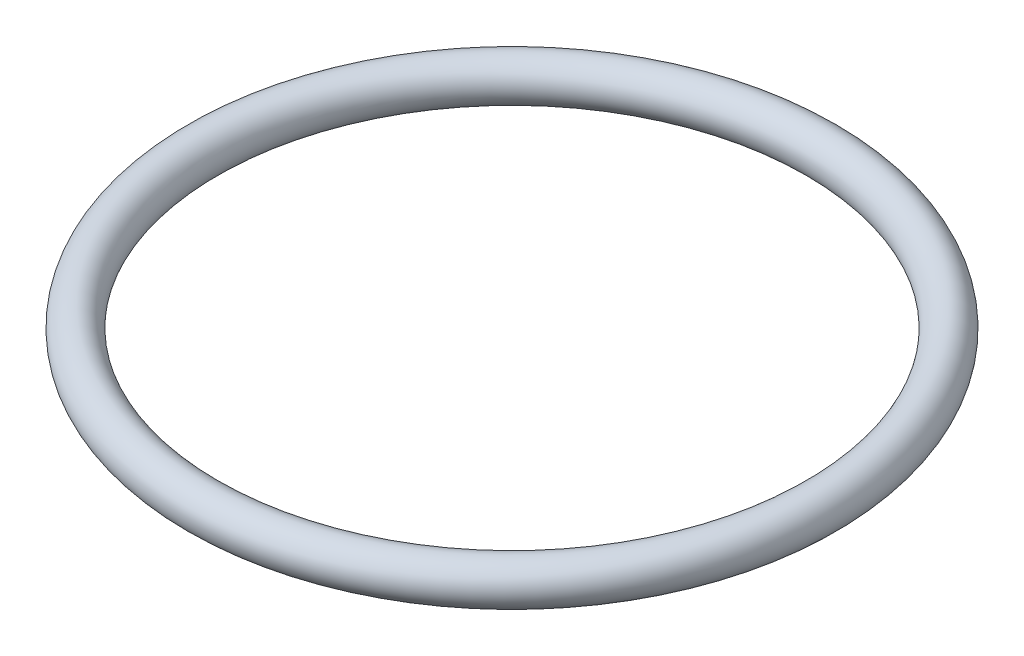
ISO-10303-21;
HEADER;
FILE_DESCRIPTION(('STEP AP214'),'2;1');
FILE_NAME('part.step','',(''),(''),'','','');
FILE_SCHEMA(('AUTOMOTIVE_DESIGN { 1 0 10303 214 1 1 1 1 }'));
ENDSEC;
DATA;
#1=APPLICATION_CONTEXT('core data for automotive mechanical design processes');
#2=APPLICATION_PROTOCOL_DEFINITION('international standard','automotive_design',2000,#1);
#3=PRODUCT_CONTEXT('',#1,'mechanical');
#4=PRODUCT('Part','Part','',(#3));
#5=PRODUCT_RELATED_PRODUCT_CATEGORY('part','',(#4));
#6=PRODUCT_DEFINITION_FORMATION('','',#4);
#7=PRODUCT_DEFINITION_CONTEXT('part definition',#1,'design');
#8=PRODUCT_DEFINITION('design','',#6,#7);
#9=PRODUCT_DEFINITION_SHAPE('','',#8);
#10=(LENGTH_UNIT() NAMED_UNIT(*) SI_UNIT(.MILLI.,.METRE.));
#11=(NAMED_UNIT(*) PLANE_ANGLE_UNIT() SI_UNIT($,.RADIAN.));
#12=(NAMED_UNIT(*) SI_UNIT($,.STERADIAN.) SOLID_ANGLE_UNIT());
#13=UNCERTAINTY_MEASURE_WITH_UNIT(LENGTH_MEASURE(1.E-05),#10,'distance_accuracy_value','');
#14=(GEOMETRIC_REPRESENTATION_CONTEXT(3) GLOBAL_UNCERTAINTY_ASSIGNED_CONTEXT((#13)) GLOBAL_UNIT_ASSIGNED_CONTEXT((#10,
#11,#12)) REPRESENTATION_CONTEXT('',''));
#15=CARTESIAN_POINT('',(0.,0.,0.));
#16=DIRECTION('',(0.,0.,1.));
#17=DIRECTION('',(1.,0.,0.));
#18=AXIS2_PLACEMENT_3D('',#15,#16,#17);
#19=CARTESIAN_POINT('',(0.,0.,0.));
#20=DIRECTION('',(0.,1.,0.));
#21=DIRECTION('',(0.,0.,1.));
#22=AXIS2_PLACEMENT_3D('',#19,#20,#21);
#23=TOROIDAL_SURFACE('',#22,19.3929,1.3081);
#24=CARTESIAN_POINT('',(0.,0.,20.701));
#25=VERTEX_POINT('',#24);
#26=VERTEX_LOOP('',#25);
#27=FACE_BOUND('',#26,.T.);
#28=ADVANCED_FACE('F35',(#27),#23,.T.);
#29=CLOSED_SHELL('',(#28));
#30=MANIFOLD_SOLID_BREP('B2',#29);
#31=ADVANCED_BREP_SHAPE_REPRESENTATION('',(#18,#30),#14);
#32=SHAPE_DEFINITION_REPRESENTATION(#9,#31);
ENDSEC;
END-ISO-10303-21;
